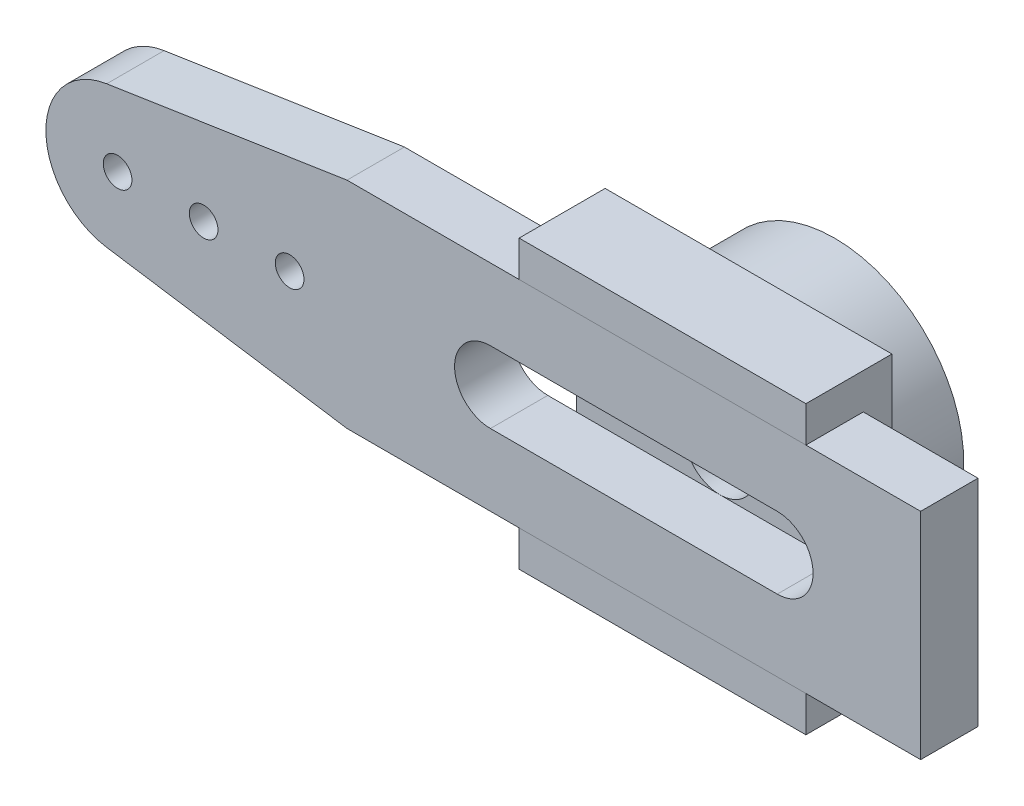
ISO-10303-21;
HEADER;
FILE_DESCRIPTION(('STEP AP214'),'2;1');
FILE_NAME('part.step','',(''),(''),'','','');
FILE_SCHEMA(('AUTOMOTIVE_DESIGN { 1 0 10303 214 1 1 1 1 }'));
ENDSEC;
DATA;
#1=APPLICATION_CONTEXT('core data for automotive mechanical design processes');
#2=APPLICATION_PROTOCOL_DEFINITION('international standard','automotive_design',2000,#1);
#3=PRODUCT_CONTEXT('',#1,'mechanical');
#4=PRODUCT('Part','Part','',(#3));
#5=PRODUCT_RELATED_PRODUCT_CATEGORY('part','',(#4));
#6=PRODUCT_DEFINITION_FORMATION('','',#4);
#7=PRODUCT_DEFINITION_CONTEXT('part definition',#1,'design');
#8=PRODUCT_DEFINITION('design','',#6,#7);
#9=PRODUCT_DEFINITION_SHAPE('','',#8);
#10=(LENGTH_UNIT() NAMED_UNIT(*) SI_UNIT(.MILLI.,.METRE.));
#11=(NAMED_UNIT(*) PLANE_ANGLE_UNIT() SI_UNIT($,.RADIAN.));
#12=(NAMED_UNIT(*) SI_UNIT($,.STERADIAN.) SOLID_ANGLE_UNIT());
#13=UNCERTAINTY_MEASURE_WITH_UNIT(LENGTH_MEASURE(1.E-05),#10,'distance_accuracy_value','');
#14=(GEOMETRIC_REPRESENTATION_CONTEXT(3) GLOBAL_UNCERTAINTY_ASSIGNED_CONTEXT((#13)) GLOBAL_UNIT_ASSIGNED_CONTEXT((#10,
#11,#12)) REPRESENTATION_CONTEXT('',''));
#15=CARTESIAN_POINT('',(0.,0.,0.));
#16=DIRECTION('',(0.,0.,1.));
#17=DIRECTION('',(1.,0.,0.));
#18=AXIS2_PLACEMENT_3D('',#15,#16,#17);
#19=CARTESIAN_POINT('',(-9.,0.,0.));
#20=DIRECTION('',(0.,0.,-1.));
#21=DIRECTION('',(0.,1.,0.));
#22=AXIS2_PLACEMENT_3D('',#19,#20,#21);
#23=CYLINDRICAL_SURFACE('',#22,1.25);
#24=CARTESIAN_POINT('',(-9.,0.,0.));
#25=DIRECTION('',(0.,0.,-1.));
#26=DIRECTION('',(0.,1.,0.));
#27=AXIS2_PLACEMENT_3D('',#24,#25,#26);
#28=CIRCLE('',#27,1.25);
#29=CARTESIAN_POINT('',(-9.,1.25,0.));
#30=VERTEX_POINT('',#29);
#31=EDGE_CURVE('E148',#30,#30,#28,.T.);
#32=ORIENTED_EDGE('',*,*,#31,.F.);
#33=EDGE_LOOP('',(#32));
#34=FACE_BOUND('',#33,.T.);
#35=CARTESIAN_POINT('',(-9.,0.,-1.3));
#36=DIRECTION('',(0.,0.,-1.));
#37=DIRECTION('',(0.,1.,0.));
#38=AXIS2_PLACEMENT_3D('',#35,#36,#37);
#39=CIRCLE('',#38,1.25);
#40=CARTESIAN_POINT('',(-9.,1.25,-1.3));
#41=VERTEX_POINT('',#40);
#42=EDGE_CURVE('E48',#41,#41,#39,.F.);
#43=ORIENTED_EDGE('',*,*,#42,.F.);
#44=EDGE_LOOP('',(#43));
#45=FACE_BOUND('',#44,.T.);
#46=ADVANCED_FACE('F44',(#34,#45),#23,.F.);
#47=CARTESIAN_POINT('',(-14.,5.,-1.));
#48=DIRECTION('',(0.,0.,-1.));
#49=DIRECTION('',(0.,1.,0.));
#50=AXIS2_PLACEMENT_3D('',#47,#48,#49);
#51=PLANE('',#50);
#52=DIRECTION('',(0.,1.,0.));
#53=VECTOR('',#52,1.);
#54=CARTESIAN_POINT('',(-4.,5.,-1.));
#55=LINE('',#54,#53);
#56=CARTESIAN_POINT('',(-4.,-5.,-1.));
#57=VERTEX_POINT('',#56);
#58=CARTESIAN_POINT('',(-4.,5.,-1.));
#59=VERTEX_POINT('',#58);
#60=EDGE_CURVE('E160',#57,#59,#55,.T.);
#61=ORIENTED_EDGE('',*,*,#60,.F.);
#62=DIRECTION('',(1.,0.,0.));
#63=VECTOR('',#62,1.);
#64=CARTESIAN_POINT('',(-14.,-5.,-1.));
#65=LINE('',#64,#63);
#66=CARTESIAN_POINT('',(-14.,-5.,-1.));
#67=VERTEX_POINT('',#66);
#68=EDGE_CURVE('E125',#67,#57,#65,.T.);
#69=ORIENTED_EDGE('',*,*,#68,.F.);
#70=DIRECTION('',(0.,1.,0.));
#71=VECTOR('',#70,1.);
#72=CARTESIAN_POINT('',(-14.,5.,-1.));
#73=LINE('',#72,#71);
#74=CARTESIAN_POINT('',(-14.,5.,-1.));
#75=VERTEX_POINT('',#74);
#76=EDGE_CURVE('E131',#67,#75,#73,.T.);
#77=ORIENTED_EDGE('',*,*,#76,.T.);
#78=DIRECTION('',(1.,0.,0.));
#79=VECTOR('',#78,1.);
#80=CARTESIAN_POINT('',(-14.,5.,-1.));
#81=LINE('',#80,#79);
#82=EDGE_CURVE('E115',#75,#59,#81,.T.);
#83=ORIENTED_EDGE('',*,*,#82,.T.);
#84=EDGE_LOOP('',(#61,#69,#77,#83));
#85=FACE_BOUND('',#84,.T.);
#86=CARTESIAN_POINT('',(-9.,0.,-1.));
#87=DIRECTION('',(0.,0.,-1.));
#88=DIRECTION('',(0.,1.,0.));
#89=AXIS2_PLACEMENT_3D('',#86,#87,#88);
#90=CIRCLE('',#89,4.50000000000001);
#91=CARTESIAN_POINT('',(-9.,4.50000000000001,-1.));
#92=VERTEX_POINT('',#91);
#93=EDGE_CURVE('E230',#92,#92,#90,.T.);
#94=ORIENTED_EDGE('',*,*,#93,.F.);
#95=EDGE_LOOP('',(#94));
#96=FACE_BOUND('',#95,.T.);
#97=ADVANCED_FACE('F135',(#85,#96),#51,.T.);
#98=CARTESIAN_POINT('',(-14.,3.75,2.));
#99=DIRECTION('',(0.,-1.,0.));
#100=DIRECTION('',(1.,0.,0.));
#101=AXIS2_PLACEMENT_3D('',#98,#99,#100);
#102=PLANE('',#101);
#103=DIRECTION('',(0.,0.,-1.));
#104=VECTOR('',#103,1.);
#105=CARTESIAN_POINT('',(-4.,3.75,2.));
#106=LINE('',#105,#104);
#107=CARTESIAN_POINT('',(-4.,3.75,2.));
#108=VERTEX_POINT('',#107);
#109=CARTESIAN_POINT('',(-4.,3.75,0.));
#110=VERTEX_POINT('',#109);
#111=EDGE_CURVE('E144',#108,#110,#106,.T.);
#112=ORIENTED_EDGE('',*,*,#111,.F.);
#113=DIRECTION('',(1.,0.,0.));
#114=VECTOR('',#113,1.);
#115=CARTESIAN_POINT('',(-14.,3.75,2.));
#116=LINE('',#115,#114);
#117=CARTESIAN_POINT('',(-14.,3.75,2.));
#118=VERTEX_POINT('',#117);
#119=EDGE_CURVE('E12',#118,#108,#116,.T.);
#120=ORIENTED_EDGE('',*,*,#119,.F.);
#121=DIRECTION('',(0.,0.,-1.));
#122=VECTOR('',#121,1.);
#123=CARTESIAN_POINT('',(-14.,3.75,2.));
#124=LINE('',#123,#122);
#125=CARTESIAN_POINT('',(-14.,3.75,0.));
#126=VERTEX_POINT('',#125);
#127=EDGE_CURVE('E165',#118,#126,#124,.T.);
#128=ORIENTED_EDGE('',*,*,#127,.T.);
#129=DIRECTION('',(1.,0.,0.));
#130=VECTOR('',#129,1.);
#131=CARTESIAN_POINT('',(-14.,3.75,0.));
#132=LINE('',#131,#130);
#133=EDGE_CURVE('E101',#126,#110,#132,.T.);
#134=ORIENTED_EDGE('',*,*,#133,.T.);
#135=EDGE_LOOP('',(#112,#120,#128,#134));
#136=FACE_BOUND('',#135,.T.);
#137=ADVANCED_FACE('F46',(#136),#102,.T.);
#138=CARTESIAN_POINT('',(-14.,3.75,2.));
#139=DIRECTION('',(0.,0.,1.));
#140=DIRECTION('',(1.,0.,0.));
#141=AXIS2_PLACEMENT_3D('',#138,#139,#140);
#142=PLANE('',#141);
#143=DIRECTION('',(0.,-1.,0.));
#144=VECTOR('',#143,1.);
#145=CARTESIAN_POINT('',(-4.,3.75,2.));
#146=LINE('',#145,#144);
#147=CARTESIAN_POINT('',(-4.,5.,2.));
#148=VERTEX_POINT('',#147);
#149=EDGE_CURVE('E163',#148,#108,#146,.T.);
#150=ORIENTED_EDGE('',*,*,#149,.F.);
#151=DIRECTION('',(1.,0.,0.));
#152=VECTOR('',#151,1.);
#153=CARTESIAN_POINT('',(-14.,5.,2.));
#154=LINE('',#153,#152);
#155=CARTESIAN_POINT('',(-14.,5.,2.));
#156=VERTEX_POINT('',#155);
#157=EDGE_CURVE('E54',#156,#148,#154,.T.);
#158=ORIENTED_EDGE('',*,*,#157,.F.);
#159=DIRECTION('',(0.,-1.,0.));
#160=VECTOR('',#159,1.);
#161=CARTESIAN_POINT('',(-14.,3.75,2.));
#162=LINE('',#161,#160);
#163=EDGE_CURVE('E133',#156,#118,#162,.T.);
#164=ORIENTED_EDGE('',*,*,#163,.T.);
#165=ORIENTED_EDGE('',*,*,#119,.T.);
#166=EDGE_LOOP('',(#150,#158,#164,#165));
#167=FACE_BOUND('',#166,.T.);
#168=ADVANCED_FACE('F178',(#167),#142,.T.);
#169=CARTESIAN_POINT('',(-14.,5.,2.));
#170=DIRECTION('',(0.,1.,0.));
#171=DIRECTION('',(-1.,0.,0.));
#172=AXIS2_PLACEMENT_3D('',#169,#170,#171);
#173=PLANE('',#172);
#174=DIRECTION('',(0.,0.,1.));
#175=VECTOR('',#174,1.);
#176=CARTESIAN_POINT('',(-4.,5.,2.));
#177=LINE('',#176,#175);
#178=EDGE_CURVE('E120',#59,#148,#177,.T.);
#179=ORIENTED_EDGE('',*,*,#178,.F.);
#180=ORIENTED_EDGE('',*,*,#82,.F.);
#181=DIRECTION('',(0.,0.,1.));
#182=VECTOR('',#181,1.);
#183=CARTESIAN_POINT('',(-14.,5.,2.));
#184=LINE('',#183,#182);
#185=EDGE_CURVE('E118',#75,#156,#184,.T.);
#186=ORIENTED_EDGE('',*,*,#185,.T.);
#187=ORIENTED_EDGE('',*,*,#157,.T.);
#188=EDGE_LOOP('',(#179,#180,#186,#187));
#189=FACE_BOUND('',#188,.T.);
#190=ADVANCED_FACE('F117',(#189),#173,.T.);
#191=CARTESIAN_POINT('',(-14.,-5.,-1.));
#192=DIRECTION('',(0.,-1.,0.));
#193=DIRECTION('',(1.,0.,0.));
#194=AXIS2_PLACEMENT_3D('',#191,#192,#193);
#195=PLANE('',#194);
#196=DIRECTION('',(0.,0.,-1.));
#197=VECTOR('',#196,1.);
#198=CARTESIAN_POINT('',(-4.,-5.,-1.));
#199=LINE('',#198,#197);
#200=CARTESIAN_POINT('',(-4.,-5.,2.));
#201=VERTEX_POINT('',#200);
#202=EDGE_CURVE('E157',#201,#57,#199,.T.);
#203=ORIENTED_EDGE('',*,*,#202,.F.);
#204=DIRECTION('',(1.,0.,0.));
#205=VECTOR('',#204,1.);
#206=CARTESIAN_POINT('',(-14.,-5.,2.));
#207=LINE('',#206,#205);
#208=CARTESIAN_POINT('',(-14.,-5.,2.));
#209=VERTEX_POINT('',#208);
#210=EDGE_CURVE('E169',#209,#201,#207,.T.);
#211=ORIENTED_EDGE('',*,*,#210,.F.);
#212=DIRECTION('',(0.,0.,-1.));
#213=VECTOR('',#212,1.);
#214=CARTESIAN_POINT('',(-14.,-5.,-1.));
#215=LINE('',#214,#213);
#216=EDGE_CURVE('E137',#209,#67,#215,.T.);
#217=ORIENTED_EDGE('',*,*,#216,.T.);
#218=ORIENTED_EDGE('',*,*,#68,.T.);
#219=EDGE_LOOP('',(#203,#211,#217,#218));
#220=FACE_BOUND('',#219,.T.);
#221=ADVANCED_FACE('F185',(#220),#195,.T.);
#222=CARTESIAN_POINT('',(-14.,-5.,2.));
#223=DIRECTION('',(0.,0.,1.));
#224=DIRECTION('',(1.,0.,0.));
#225=AXIS2_PLACEMENT_3D('',#222,#223,#224);
#226=PLANE('',#225);
#227=DIRECTION('',(0.,-1.,0.));
#228=VECTOR('',#227,1.);
#229=CARTESIAN_POINT('',(-4.,-5.,2.));
#230=LINE('',#229,#228);
#231=CARTESIAN_POINT('',(-4.,-3.75,2.));
#232=VERTEX_POINT('',#231);
#233=EDGE_CURVE('E154',#232,#201,#230,.T.);
#234=ORIENTED_EDGE('',*,*,#233,.F.);
#235=DIRECTION('',(1.,0.,0.));
#236=VECTOR('',#235,1.);
#237=CARTESIAN_POINT('',(-14.,-3.75,2.));
#238=LINE('',#237,#236);
#239=CARTESIAN_POINT('',(-14.,-3.75,2.));
#240=VERTEX_POINT('',#239);
#241=EDGE_CURVE('E171',#240,#232,#238,.T.);
#242=ORIENTED_EDGE('',*,*,#241,.F.);
#243=DIRECTION('',(0.,-1.,0.));
#244=VECTOR('',#243,1.);
#245=CARTESIAN_POINT('',(-14.,-5.,2.));
#246=LINE('',#245,#244);
#247=EDGE_CURVE('E139',#240,#209,#246,.T.);
#248=ORIENTED_EDGE('',*,*,#247,.T.);
#249=ORIENTED_EDGE('',*,*,#210,.T.);
#250=EDGE_LOOP('',(#234,#242,#248,#249));
#251=FACE_BOUND('',#250,.T.);
#252=ADVANCED_FACE('F252',(#251),#226,.T.);
#253=CARTESIAN_POINT('',(-14.,-3.75,2.));
#254=DIRECTION('',(0.,1.,0.));
#255=DIRECTION('',(-1.,0.,0.));
#256=AXIS2_PLACEMENT_3D('',#253,#254,#255);
#257=PLANE('',#256);
#258=DIRECTION('',(0.,0.,1.));
#259=VECTOR('',#258,1.);
#260=CARTESIAN_POINT('',(-4.,-3.75,2.));
#261=LINE('',#260,#259);
#262=CARTESIAN_POINT('',(-4.,-3.75,0.));
#263=VERTEX_POINT('',#262);
#264=EDGE_CURVE('E151',#263,#232,#261,.T.);
#265=ORIENTED_EDGE('',*,*,#264,.F.);
#266=DIRECTION('',(1.,0.,0.));
#267=VECTOR('',#266,1.);
#268=CARTESIAN_POINT('',(-14.,-3.75,0.));
#269=LINE('',#268,#267);
#270=CARTESIAN_POINT('',(-14.,-3.75,0.));
#271=VERTEX_POINT('',#270);
#272=EDGE_CURVE('E173',#271,#263,#269,.T.);
#273=ORIENTED_EDGE('',*,*,#272,.F.);
#274=DIRECTION('',(0.,0.,1.));
#275=VECTOR('',#274,1.);
#276=CARTESIAN_POINT('',(-14.,-3.75,2.));
#277=LINE('',#276,#275);
#278=EDGE_CURVE('E246',#271,#240,#277,.T.);
#279=ORIENTED_EDGE('',*,*,#278,.T.);
#280=ORIENTED_EDGE('',*,*,#241,.T.);
#281=EDGE_LOOP('',(#265,#273,#279,#280));
#282=FACE_BOUND('',#281,.T.);
#283=ADVANCED_FACE('F256',(#282),#257,.T.);
#284=CARTESIAN_POINT('',(-14.,-3.75,0.));
#285=DIRECTION('',(0.,0.,1.));
#286=DIRECTION('',(1.,0.,0.));
#287=AXIS2_PLACEMENT_3D('',#284,#285,#286);
#288=PLANE('',#287);
#289=ORIENTED_EDGE('',*,*,#31,.T.);
#290=EDGE_LOOP('',(#289));
#291=FACE_BOUND('',#290,.T.);
#292=DIRECTION('',(0.,-1.,0.));
#293=VECTOR('',#292,1.);
#294=CARTESIAN_POINT('',(-4.,-3.75,0.));
#295=LINE('',#294,#293);
#296=EDGE_CURVE('E147',#110,#263,#295,.T.);
#297=ORIENTED_EDGE('',*,*,#296,.F.);
#298=ORIENTED_EDGE('',*,*,#133,.F.);
#299=DIRECTION('',(0.,-1.,0.));
#300=VECTOR('',#299,1.);
#301=CARTESIAN_POINT('',(-14.,-3.75,0.));
#302=LINE('',#301,#300);
#303=EDGE_CURVE('E244',#126,#271,#302,.T.);
#304=ORIENTED_EDGE('',*,*,#303,.T.);
#305=ORIENTED_EDGE('',*,*,#272,.T.);
#306=EDGE_LOOP('',(#297,#298,#304,#305));
#307=FACE_BOUND('',#306,.T.);
#308=ADVANCED_FACE('F174',(#291,#307),#288,.T.);
#309=CARTESIAN_POINT('',(-14.,3.75,0.));
#310=DIRECTION('',(1.,0.,0.));
#311=DIRECTION('',(0.,1.,0.));
#312=AXIS2_PLACEMENT_3D('',#309,#310,#311);
#313=PLANE('',#312);
#314=ORIENTED_EDGE('',*,*,#127,.F.);
#315=ORIENTED_EDGE('',*,*,#163,.F.);
#316=ORIENTED_EDGE('',*,*,#185,.F.);
#317=ORIENTED_EDGE('',*,*,#76,.F.);
#318=ORIENTED_EDGE('',*,*,#216,.F.);
#319=ORIENTED_EDGE('',*,*,#247,.F.);
#320=ORIENTED_EDGE('',*,*,#278,.F.);
#321=ORIENTED_EDGE('',*,*,#303,.F.);
#322=EDGE_LOOP('',(#314,#315,#316,#317,#318,#319,#320,#321));
#323=FACE_BOUND('',#322,.T.);
#324=ADVANCED_FACE('F129',(#323),#313,.F.);
#325=CARTESIAN_POINT('',(-4.,3.75,0.));
#326=DIRECTION('',(1.,0.,0.));
#327=DIRECTION('',(0.,1.,0.));
#328=AXIS2_PLACEMENT_3D('',#325,#326,#327);
#329=PLANE('',#328);
#330=ORIENTED_EDGE('',*,*,#111,.T.);
#331=ORIENTED_EDGE('',*,*,#296,.T.);
#332=ORIENTED_EDGE('',*,*,#264,.T.);
#333=ORIENTED_EDGE('',*,*,#233,.T.);
#334=ORIENTED_EDGE('',*,*,#202,.T.);
#335=ORIENTED_EDGE('',*,*,#60,.T.);
#336=ORIENTED_EDGE('',*,*,#178,.T.);
#337=ORIENTED_EDGE('',*,*,#149,.T.);
#338=EDGE_LOOP('',(#330,#331,#332,#333,#334,#335,#336,#337));
#339=FACE_BOUND('',#338,.T.);
#340=ADVANCED_FACE('F177',(#339),#329,.T.);
#341=CARTESIAN_POINT('',(-9.,0.,-4.));
#342=DIRECTION('',(0.,0.,-1.));
#343=DIRECTION('',(0.,1.,0.));
#344=AXIS2_PLACEMENT_3D('',#341,#342,#343);
#345=PLANE('',#344);
#346=CARTESIAN_POINT('',(-9.,0.,-4.));
#347=DIRECTION('',(0.,0.,-1.));
#348=DIRECTION('',(0.,1.,0.));
#349=AXIS2_PLACEMENT_3D('',#346,#347,#348);
#350=CIRCLE('',#349,2.9);
#351=CARTESIAN_POINT('',(-9.,2.9,-4.));
#352=VERTEX_POINT('',#351);
#353=EDGE_CURVE('E234',#352,#352,#350,.T.);
#354=ORIENTED_EDGE('',*,*,#353,.F.);
#355=EDGE_LOOP('',(#354));
#356=FACE_BOUND('',#355,.T.);
#357=CARTESIAN_POINT('',(-9.,0.,-4.));
#358=DIRECTION('',(0.,0.,-1.));
#359=DIRECTION('',(0.,1.,0.));
#360=AXIS2_PLACEMENT_3D('',#357,#358,#359);
#361=CIRCLE('',#360,4.50000000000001);
#362=CARTESIAN_POINT('',(-9.,4.50000000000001,-4.));
#363=VERTEX_POINT('',#362);
#364=EDGE_CURVE('E232',#363,#363,#361,.T.);
#365=ORIENTED_EDGE('',*,*,#364,.T.);
#366=EDGE_LOOP('',(#365));
#367=FACE_BOUND('',#366,.T.);
#368=ADVANCED_FACE('F203',(#356,#367),#345,.T.);
#369=CARTESIAN_POINT('',(-9.,0.,-4.));
#370=DIRECTION('',(0.,0.,1.));
#371=DIRECTION('',(0.,-1.,0.));
#372=AXIS2_PLACEMENT_3D('',#369,#370,#371);
#373=CYLINDRICAL_SURFACE('',#372,4.50000000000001);
#374=ORIENTED_EDGE('',*,*,#364,.F.);
#375=EDGE_LOOP('',(#374));
#376=FACE_BOUND('',#375,.T.);
#377=ORIENTED_EDGE('',*,*,#93,.T.);
#378=EDGE_LOOP('',(#377));
#379=FACE_BOUND('',#378,.T.);
#380=ADVANCED_FACE('F199',(#376,#379),#373,.T.);
#381=CARTESIAN_POINT('',(-9.,0.,-1.3));
#382=DIRECTION('',(0.,0.,-1.));
#383=DIRECTION('',(0.,1.,0.));
#384=AXIS2_PLACEMENT_3D('',#381,#382,#383);
#385=PLANE('',#384);
#386=CARTESIAN_POINT('',(-9.,0.,-1.3));
#387=DIRECTION('',(0.,0.,-1.));
#388=DIRECTION('',(0.,1.,0.));
#389=AXIS2_PLACEMENT_3D('',#386,#387,#388);
#390=CIRCLE('',#389,2.9);
#391=CARTESIAN_POINT('',(-9.,2.9,-1.3));
#392=VERTEX_POINT('',#391);
#393=EDGE_CURVE('E227',#392,#392,#390,.T.);
#394=ORIENTED_EDGE('',*,*,#393,.T.);
#395=EDGE_LOOP('',(#394));
#396=FACE_BOUND('',#395,.T.);
#397=ORIENTED_EDGE('',*,*,#42,.T.);
#398=EDGE_LOOP('',(#397));
#399=FACE_BOUND('',#398,.T.);
#400=ADVANCED_FACE('F211',(#396,#399),#385,.T.);
#401=CARTESIAN_POINT('',(-9.,0.,-1.3));
#402=DIRECTION('',(0.,0.,-1.));
#403=DIRECTION('',(0.,1.,0.));
#404=AXIS2_PLACEMENT_3D('',#401,#402,#403);
#405=CYLINDRICAL_SURFACE('',#404,2.9);
#406=CARTESIAN_POINT('',(-9.,2.9,-1.3));
#407=CARTESIAN_POINT('',(-9.,2.9,-1.328125));
#408=CARTESIAN_POINT('',(-9.,2.9,-1.35625));
#409=CARTESIAN_POINT('',(-9.,2.9,-1.4125));
#410=CARTESIAN_POINT('',(-9.,2.9,-1.440625));
#411=CARTESIAN_POINT('',(-9.,2.9,-1.496875));
#412=CARTESIAN_POINT('',(-9.,2.9,-1.525));
#413=CARTESIAN_POINT('',(-9.,2.9,-1.58125));
#414=CARTESIAN_POINT('',(-9.,2.9,-1.609375));
#415=CARTESIAN_POINT('',(-9.,2.9,-1.665625));
#416=CARTESIAN_POINT('',(-9.,2.9,-1.69375));
#417=CARTESIAN_POINT('',(-9.,2.9,-1.75));
#418=CARTESIAN_POINT('',(-9.,2.9,-1.778125));
#419=CARTESIAN_POINT('',(-9.,2.9,-1.834375));
#420=CARTESIAN_POINT('',(-9.,2.9,-1.8625));
#421=CARTESIAN_POINT('',(-9.,2.9,-1.91875));
#422=CARTESIAN_POINT('',(-9.,2.9,-1.946875));
#423=CARTESIAN_POINT('',(-9.,2.9,-2.003125));
#424=CARTESIAN_POINT('',(-9.,2.9,-2.03125));
#425=CARTESIAN_POINT('',(-9.,2.9,-2.0875));
#426=CARTESIAN_POINT('',(-9.,2.9,-2.115625));
#427=CARTESIAN_POINT('',(-9.,2.9,-2.171875));
#428=CARTESIAN_POINT('',(-9.,2.9,-2.2));
#429=CARTESIAN_POINT('',(-9.,2.9,-2.25625));
#430=CARTESIAN_POINT('',(-9.,2.9,-2.284375));
#431=CARTESIAN_POINT('',(-9.,2.9,-2.340625));
#432=CARTESIAN_POINT('',(-9.,2.9,-2.36875));
#433=CARTESIAN_POINT('',(-9.,2.9,-2.425));
#434=CARTESIAN_POINT('',(-9.,2.9,-2.453125));
#435=CARTESIAN_POINT('',(-9.,2.9,-2.509375));
#436=CARTESIAN_POINT('',(-9.,2.9,-2.5375));
#437=CARTESIAN_POINT('',(-9.,2.9,-2.59375));
#438=CARTESIAN_POINT('',(-9.,2.9,-2.621875));
#439=CARTESIAN_POINT('',(-9.,2.9,-2.678125));
#440=CARTESIAN_POINT('',(-9.,2.9,-2.70625));
#441=CARTESIAN_POINT('',(-9.,2.9,-2.7625));
#442=CARTESIAN_POINT('',(-9.,2.9,-2.790625));
#443=CARTESIAN_POINT('',(-9.,2.9,-2.846875));
#444=CARTESIAN_POINT('',(-9.,2.9,-2.875));
#445=CARTESIAN_POINT('',(-9.,2.9,-2.93125));
#446=CARTESIAN_POINT('',(-9.,2.9,-2.959375));
#447=CARTESIAN_POINT('',(-9.,2.9,-3.015625));
#448=CARTESIAN_POINT('',(-9.,2.9,-3.04375));
#449=CARTESIAN_POINT('',(-9.,2.9,-3.1));
#450=CARTESIAN_POINT('',(-9.,2.9,-3.128125));
#451=CARTESIAN_POINT('',(-9.,2.9,-3.184375));
#452=CARTESIAN_POINT('',(-9.,2.9,-3.2125));
#453=CARTESIAN_POINT('',(-9.,2.9,-3.26875));
#454=CARTESIAN_POINT('',(-9.,2.9,-3.296875));
#455=CARTESIAN_POINT('',(-9.,2.9,-3.353125));
#456=CARTESIAN_POINT('',(-9.,2.9,-3.38125));
#457=CARTESIAN_POINT('',(-9.,2.9,-3.4375));
#458=CARTESIAN_POINT('',(-9.,2.9,-3.465625));
#459=CARTESIAN_POINT('',(-9.,2.9,-3.521875));
#460=CARTESIAN_POINT('',(-9.,2.9,-3.55));
#461=CARTESIAN_POINT('',(-9.,2.9,-3.60625));
#462=CARTESIAN_POINT('',(-9.,2.9,-3.634375));
#463=CARTESIAN_POINT('',(-9.,2.9,-3.690625));
#464=CARTESIAN_POINT('',(-9.,2.9,-3.71875));
#465=CARTESIAN_POINT('',(-9.,2.9,-3.775));
#466=CARTESIAN_POINT('',(-9.,2.9,-3.803125));
#467=CARTESIAN_POINT('',(-9.,2.9,-3.859375));
#468=CARTESIAN_POINT('',(-9.,2.9,-3.8875));
#469=CARTESIAN_POINT('',(-9.,2.9,-3.94375));
#470=CARTESIAN_POINT('',(-9.,2.9,-3.971875));
#471=CARTESIAN_POINT('',(-9.,2.9,-4.));
#472=B_SPLINE_CURVE_WITH_KNOTS('',3,(#406,#407,#408,#409,#410,#411,#412,#413,#414,#415,#416,
#417,#418,#419,#420,#421,#422,#423,#424,#425,#426,#427,#428,#429,#430,#431,#432,#433,#434,#435,
#436,#437,#438,#439,#440,#441,#442,#443,#444,#445,#446,#447,#448,#449,#450,#451,#452,#453,#454,
#455,#456,#457,#458,#459,#460,#461,#462,#463,#464,#465,#466,#467,#468,#469,#470,#471),
.UNSPECIFIED.,.F.,.F.,(4,2,2,2,2,2,2,2,2,2,2,2,2,2,2,2,2,2,2,2,2,2,2,2,2,2,2,2,2,2,2,2,4),(0.,
0.0843749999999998,0.16875,0.253125,0.3375,0.421875,0.50625,0.590625,0.675,0.759375,0.84375,
0.928125,1.0125,1.096875,1.18125,1.265625,1.35,1.434375,1.51875,1.603125,1.6875,1.771875,
1.85625,1.940625,2.025,2.109375,2.19375,2.278125,2.3625,2.446875,2.53125,2.615625,2.7),.UNSPECIFIED.);
#473=EDGE_CURVE('BSEAM216',#392,#352,#472,.T.);
#474=ORIENTED_EDGE('',*,*,#393,.F.);
#475=ORIENTED_EDGE('',*,*,#353,.T.);
#476=ORIENTED_EDGE('',*,*,#473,.T.);
#477=ORIENTED_EDGE('',*,*,#473,.F.);
#478=EDGE_LOOP('',(#474,#476,#475,#477));
#479=FACE_BOUND('',#478,.T.);
#480=ADVANCED_FACE('F216',(#479),#405,.F.);
#481=CLOSED_SHELL('',(#46,#97,#137,#168,#190,#221,#252,#283,#308,#324,#340,#368,#380,#400,#480));
#482=MANIFOLD_SOLID_BREP('B2',#481);
#483=CARTESIAN_POINT('',(-28.,0.,2.));
#484=DIRECTION('',(0.,0.,1.));
#485=DIRECTION('',(1.,0.,0.));
#486=AXIS2_PLACEMENT_3D('',#483,#484,#485);
#487=PLANE('',#486);
#488=CARTESIAN_POINT('',(-22.,0.,2.));
#489=DIRECTION('',(0.,0.,1.));
#490=DIRECTION('',(1.,0.,0.));
#491=AXIS2_PLACEMENT_3D('',#488,#489,#490);
#492=CIRCLE('',#491,0.499999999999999);
#493=CARTESIAN_POINT('',(-21.5,0.,2.));
#494=VERTEX_POINT('',#493);
#495=EDGE_CURVE('E468',#494,#494,#492,.T.);
#496=ORIENTED_EDGE('',*,*,#495,.F.);
#497=EDGE_LOOP('',(#496));
#498=FACE_BOUND('',#497,.T.);
#499=CARTESIAN_POINT('',(-28.,0.,2.));
#500=DIRECTION('',(0.,0.,1.));
#501=DIRECTION('',(1.,0.,0.));
#502=AXIS2_PLACEMENT_3D('',#499,#500,#501);
#503=CIRCLE('',#502,0.499999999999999);
#504=CARTESIAN_POINT('',(-27.5,0.,2.));
#505=VERTEX_POINT('',#504);
#506=EDGE_CURVE('E480',#505,#505,#503,.T.);
#507=ORIENTED_EDGE('',*,*,#506,.F.);
#508=EDGE_LOOP('',(#507));
#509=FACE_BOUND('',#508,.T.);
#510=DIRECTION('',(-1.,0.,0.));
#511=VECTOR('',#510,1.);
#512=CARTESIAN_POINT('',(0.,3.75,2.));
#513=LINE('',#512,#511);
#514=CARTESIAN_POINT('',(0.,3.75,2.));
#515=VERTEX_POINT('',#514);
#516=CARTESIAN_POINT('',(-20.,3.75,2.));
#517=VERTEX_POINT('',#516);
#518=EDGE_CURVE('E486',#515,#517,#513,.T.);
#519=ORIENTED_EDGE('',*,*,#518,.T.);
#520=DIRECTION('',(-0.988551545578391,-0.15088353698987,0.));
#521=VECTOR('',#520,1.);
#522=CARTESIAN_POINT('',(-20.,3.75,2.));
#523=LINE('',#522,#521);
#524=CARTESIAN_POINT('',(-28.3772088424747,2.47137886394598,2.));
#525=VERTEX_POINT('',#524);
#526=EDGE_CURVE('E489',#517,#525,#523,.T.);
#527=ORIENTED_EDGE('',*,*,#526,.T.);
#528=CARTESIAN_POINT('',(-28.,0.,2.));
#529=DIRECTION('',(0.,0.,1.));
#530=DIRECTION('',(1.,0.,0.));
#531=AXIS2_PLACEMENT_3D('',#528,#529,#530);
#532=CIRCLE('',#531,2.5);
#533=CARTESIAN_POINT('',(-28.3772088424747,-2.47137886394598,2.));
#534=VERTEX_POINT('',#533);
#535=EDGE_CURVE('E492',#525,#534,#532,.T.);
#536=ORIENTED_EDGE('',*,*,#535,.T.);
#537=DIRECTION('',(0.988551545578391,-0.15088353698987,0.));
#538=VECTOR('',#537,1.);
#539=CARTESIAN_POINT('',(-20.,-3.75,2.));
#540=LINE('',#539,#538);
#541=CARTESIAN_POINT('',(-20.,-3.75,2.));
#542=VERTEX_POINT('',#541);
#543=EDGE_CURVE('E494',#534,#542,#540,.T.);
#544=ORIENTED_EDGE('',*,*,#543,.T.);
#545=DIRECTION('',(1.,0.,0.));
#546=VECTOR('',#545,1.);
#547=CARTESIAN_POINT('',(0.,-3.75,2.));
#548=LINE('',#547,#546);
#549=CARTESIAN_POINT('',(0.,-3.75,2.));
#550=VERTEX_POINT('',#549);
#551=EDGE_CURVE('E496',#542,#550,#548,.T.);
#552=ORIENTED_EDGE('',*,*,#551,.T.);
#553=DIRECTION('',(0.,1.,0.));
#554=VECTOR('',#553,1.);
#555=CARTESIAN_POINT('',(0.,3.75,2.));
#556=LINE('',#555,#554);
#557=EDGE_CURVE('E498',#550,#515,#556,.T.);
#558=ORIENTED_EDGE('',*,*,#557,.T.);
#559=EDGE_LOOP('',(#519,#527,#536,#544,#552,#558));
#560=FACE_BOUND('',#559,.T.);
#561=CARTESIAN_POINT('',(-25.,0.,2.));
#562=DIRECTION('',(0.,0.,1.));
#563=DIRECTION('',(1.,0.,0.));
#564=AXIS2_PLACEMENT_3D('',#561,#562,#563);
#565=CIRCLE('',#564,0.499999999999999);
#566=CARTESIAN_POINT('',(-24.5,0.,2.));
#567=VERTEX_POINT('',#566);
#568=EDGE_CURVE('E474',#567,#567,#565,.T.);
#569=ORIENTED_EDGE('',*,*,#568,.F.);
#570=EDGE_LOOP('',(#569));
#571=FACE_BOUND('',#570,.T.);
#572=DIRECTION('',(1.,0.,0.));
#573=VECTOR('',#572,1.);
#574=CARTESIAN_POINT('',(-5.,-1.25,2.));
#575=LINE('',#574,#573);
#576=CARTESIAN_POINT('',(-15.,-1.25,2.));
#577=VERTEX_POINT('',#576);
#578=CARTESIAN_POINT('',(-5.,-1.25,2.));
#579=VERTEX_POINT('',#578);
#580=EDGE_CURVE('E440',#577,#579,#575,.T.);
#581=ORIENTED_EDGE('',*,*,#580,.F.);
#582=CARTESIAN_POINT('',(-15.,0.,2.));
#583=DIRECTION('',(0.,0.,1.));
#584=DIRECTION('',(-1.,0.,0.));
#585=AXIS2_PLACEMENT_3D('',#582,#583,#584);
#586=CIRCLE('',#585,1.25);
#587=CARTESIAN_POINT('',(-15.,1.25,2.));
#588=VERTEX_POINT('',#587);
#589=EDGE_CURVE('E432',#588,#577,#586,.T.);
#590=ORIENTED_EDGE('',*,*,#589,.F.);
#591=DIRECTION('',(-1.,0.,0.));
#592=VECTOR('',#591,1.);
#593=CARTESIAN_POINT('',(-15.,1.25,2.));
#594=LINE('',#593,#592);
#595=CARTESIAN_POINT('',(-5.,1.25,2.));
#596=VERTEX_POINT('',#595);
#597=EDGE_CURVE('E454',#596,#588,#594,.T.);
#598=ORIENTED_EDGE('',*,*,#597,.F.);
#599=CARTESIAN_POINT('',(-5.,0.,2.));
#600=DIRECTION('',(0.,0.,1.));
#601=DIRECTION('',(-1.,0.,0.));
#602=AXIS2_PLACEMENT_3D('',#599,#600,#601);
#603=CIRCLE('',#602,1.25);
#604=EDGE_CURVE('E452',#579,#596,#603,.T.);
#605=ORIENTED_EDGE('',*,*,#604,.F.);
#606=EDGE_LOOP('',(#581,#590,#598,#605));
#607=FACE_BOUND('',#606,.T.);
#608=ADVANCED_FACE('F355',(#498,#509,#560,#571,#607),#487,.T.);
#609=CARTESIAN_POINT('',(-28.,0.,0.));
#610=DIRECTION('',(0.,0.,1.));
#611=DIRECTION('',(1.,0.,0.));
#612=AXIS2_PLACEMENT_3D('',#609,#610,#611);
#613=PLANE('',#612);
#614=CARTESIAN_POINT('',(-22.,0.,0.));
#615=DIRECTION('',(0.,0.,1.));
#616=DIRECTION('',(1.,0.,0.));
#617=AXIS2_PLACEMENT_3D('',#614,#615,#616);
#618=CIRCLE('',#617,0.499999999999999);
#619=CARTESIAN_POINT('',(-21.5,0.,0.));
#620=VERTEX_POINT('',#619);
#621=EDGE_CURVE('E448',#620,#620,#618,.T.);
#622=ORIENTED_EDGE('',*,*,#621,.T.);
#623=EDGE_LOOP('',(#622));
#624=FACE_BOUND('',#623,.T.);
#625=CARTESIAN_POINT('',(-28.,0.,0.));
#626=DIRECTION('',(0.,0.,1.));
#627=DIRECTION('',(1.,0.,0.));
#628=AXIS2_PLACEMENT_3D('',#625,#626,#627);
#629=CIRCLE('',#628,0.499999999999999);
#630=CARTESIAN_POINT('',(-27.5,0.,0.));
#631=VERTEX_POINT('',#630);
#632=EDGE_CURVE('E477',#631,#631,#629,.T.);
#633=ORIENTED_EDGE('',*,*,#632,.T.);
#634=EDGE_LOOP('',(#633));
#635=FACE_BOUND('',#634,.T.);
#636=DIRECTION('',(-1.,0.,0.));
#637=VECTOR('',#636,1.);
#638=CARTESIAN_POINT('',(0.,3.75,0.));
#639=LINE('',#638,#637);
#640=CARTESIAN_POINT('',(0.,3.75,0.));
#641=VERTEX_POINT('',#640);
#642=CARTESIAN_POINT('',(-20.,3.75,0.));
#643=VERTEX_POINT('',#642);
#644=EDGE_CURVE('E483',#641,#643,#639,.T.);
#645=ORIENTED_EDGE('',*,*,#644,.F.);
#646=DIRECTION('',(0.,1.,0.));
#647=VECTOR('',#646,1.);
#648=CARTESIAN_POINT('',(0.,3.75,0.));
#649=LINE('',#648,#647);
#650=CARTESIAN_POINT('',(0.,-3.75,0.));
#651=VERTEX_POINT('',#650);
#652=EDGE_CURVE('E490',#651,#641,#649,.T.);
#653=ORIENTED_EDGE('',*,*,#652,.F.);
#654=DIRECTION('',(1.,0.,0.));
#655=VECTOR('',#654,1.);
#656=CARTESIAN_POINT('',(0.,-3.75,0.));
#657=LINE('',#656,#655);
#658=CARTESIAN_POINT('',(-20.,-3.75,0.));
#659=VERTEX_POINT('',#658);
#660=EDGE_CURVE('E509',#659,#651,#657,.T.);
#661=ORIENTED_EDGE('',*,*,#660,.F.);
#662=DIRECTION('',(0.988551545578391,-0.15088353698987,0.));
#663=VECTOR('',#662,1.);
#664=CARTESIAN_POINT('',(-20.,-3.75,0.));
#665=LINE('',#664,#663);
#666=CARTESIAN_POINT('',(-28.3772088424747,-2.47137886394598,0.));
#667=VERTEX_POINT('',#666);
#668=EDGE_CURVE('E507',#667,#659,#665,.T.);
#669=ORIENTED_EDGE('',*,*,#668,.F.);
#670=CARTESIAN_POINT('',(-28.,0.,0.));
#671=DIRECTION('',(0.,0.,1.));
#672=DIRECTION('',(1.,0.,0.));
#673=AXIS2_PLACEMENT_3D('',#670,#671,#672);
#674=CIRCLE('',#673,2.5);
#675=CARTESIAN_POINT('',(-28.3772088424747,2.47137886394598,0.));
#676=VERTEX_POINT('',#675);
#677=EDGE_CURVE('E505',#676,#667,#674,.T.);
#678=ORIENTED_EDGE('',*,*,#677,.F.);
#679=DIRECTION('',(-0.988551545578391,-0.15088353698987,0.));
#680=VECTOR('',#679,1.);
#681=CARTESIAN_POINT('',(-20.,3.75,0.));
#682=LINE('',#681,#680);
#683=EDGE_CURVE('E503',#643,#676,#682,.T.);
#684=ORIENTED_EDGE('',*,*,#683,.F.);
#685=EDGE_LOOP('',(#645,#653,#661,#669,#678,#684));
#686=FACE_BOUND('',#685,.T.);
#687=CARTESIAN_POINT('',(-25.,0.,0.));
#688=DIRECTION('',(0.,0.,1.));
#689=DIRECTION('',(1.,0.,0.));
#690=AXIS2_PLACEMENT_3D('',#687,#688,#689);
#691=CIRCLE('',#690,0.499999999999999);
#692=CARTESIAN_POINT('',(-24.5,0.,0.));
#693=VERTEX_POINT('',#692);
#694=EDGE_CURVE('E471',#693,#693,#691,.T.);
#695=ORIENTED_EDGE('',*,*,#694,.T.);
#696=EDGE_LOOP('',(#695));
#697=FACE_BOUND('',#696,.T.);
#698=CARTESIAN_POINT('',(-15.,0.,0.));
#699=DIRECTION('',(0.,0.,1.));
#700=DIRECTION('',(-1.,0.,0.));
#701=AXIS2_PLACEMENT_3D('',#698,#699,#700);
#702=CIRCLE('',#701,1.25);
#703=CARTESIAN_POINT('',(-15.,1.25,0.));
#704=VERTEX_POINT('',#703);
#705=CARTESIAN_POINT('',(-15.,-1.25,0.));
#706=VERTEX_POINT('',#705);
#707=EDGE_CURVE('E378',#704,#706,#702,.T.);
#708=ORIENTED_EDGE('',*,*,#707,.T.);
#709=DIRECTION('',(1.,0.,0.));
#710=VECTOR('',#709,1.);
#711=CARTESIAN_POINT('',(-5.,-1.25,0.));
#712=LINE('',#711,#710);
#713=CARTESIAN_POINT('',(-5.,-1.25,0.));
#714=VERTEX_POINT('',#713);
#715=EDGE_CURVE('E447',#706,#714,#712,.T.);
#716=ORIENTED_EDGE('',*,*,#715,.T.);
#717=CARTESIAN_POINT('',(-5.,0.,0.));
#718=DIRECTION('',(0.,0.,1.));
#719=DIRECTION('',(-1.,0.,0.));
#720=AXIS2_PLACEMENT_3D('',#717,#718,#719);
#721=CIRCLE('',#720,1.25);
#722=CARTESIAN_POINT('',(-5.,1.25,0.));
#723=VERTEX_POINT('',#722);
#724=EDGE_CURVE('E460',#714,#723,#721,.T.);
#725=ORIENTED_EDGE('',*,*,#724,.T.);
#726=DIRECTION('',(-1.,0.,0.));
#727=VECTOR('',#726,1.);
#728=CARTESIAN_POINT('',(-15.,1.25,0.));
#729=LINE('',#728,#727);
#730=EDGE_CURVE('E441',#723,#704,#729,.T.);
#731=ORIENTED_EDGE('',*,*,#730,.T.);
#732=EDGE_LOOP('',(#708,#716,#725,#731));
#733=FACE_BOUND('',#732,.T.);
#734=ADVANCED_FACE('F533',(#624,#635,#686,#697,#733),#613,.F.);
#735=CARTESIAN_POINT('',(0.,3.75,2.));
#736=DIRECTION('',(0.,-1.,0.));
#737=DIRECTION('',(1.,0.,0.));
#738=AXIS2_PLACEMENT_3D('',#735,#736,#737);
#739=PLANE('',#738);
#740=ORIENTED_EDGE('',*,*,#644,.T.);
#741=DIRECTION('',(0.,0.,-1.));
#742=VECTOR('',#741,1.);
#743=CARTESIAN_POINT('',(-20.,3.75,2.));
#744=LINE('',#743,#742);
#745=EDGE_CURVE('E42',#517,#643,#744,.T.);
#746=ORIENTED_EDGE('',*,*,#745,.F.);
#747=ORIENTED_EDGE('',*,*,#518,.F.);
#748=DIRECTION('',(0.,0.,-1.));
#749=VECTOR('',#748,1.);
#750=CARTESIAN_POINT('',(0.,3.75,2.));
#751=LINE('',#750,#749);
#752=EDGE_CURVE('E500',#515,#641,#751,.T.);
#753=ORIENTED_EDGE('',*,*,#752,.T.);
#754=EDGE_LOOP('',(#740,#746,#747,#753));
#755=FACE_BOUND('',#754,.T.);
#756=ADVANCED_FACE('F357',(#755),#739,.F.);
#757=CARTESIAN_POINT('',(-20.,3.75,2.));
#758=DIRECTION('',(0.150883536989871,-0.988551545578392,0.));
#759=DIRECTION('',(0.988551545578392,0.150883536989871,0.));
#760=AXIS2_PLACEMENT_3D('',#757,#758,#759);
#761=PLANE('',#760);
#762=ORIENTED_EDGE('',*,*,#683,.T.);
#763=DIRECTION('',(0.,0.,-1.));
#764=VECTOR('',#763,1.);
#765=CARTESIAN_POINT('',(-28.3772088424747,2.47137886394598,2.));
#766=LINE('',#765,#764);
#767=EDGE_CURVE('E363',#525,#676,#766,.T.);
#768=ORIENTED_EDGE('',*,*,#767,.F.);
#769=ORIENTED_EDGE('',*,*,#526,.F.);
#770=ORIENTED_EDGE('',*,*,#745,.T.);
#771=EDGE_LOOP('',(#762,#768,#769,#770));
#772=FACE_BOUND('',#771,.T.);
#773=ADVANCED_FACE('F551',(#772),#761,.F.);
#774=CARTESIAN_POINT('',(-28.,0.,2.));
#775=DIRECTION('',(0.,0.,-1.));
#776=DIRECTION('',(-1.,0.,0.));
#777=AXIS2_PLACEMENT_3D('',#774,#775,#776);
#778=CYLINDRICAL_SURFACE('',#777,2.5);
#779=ORIENTED_EDGE('',*,*,#677,.T.);
#780=DIRECTION('',(0.,0.,-1.));
#781=VECTOR('',#780,1.);
#782=CARTESIAN_POINT('',(-28.3772088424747,-2.47137886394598,2.));
#783=LINE('',#782,#781);
#784=EDGE_CURVE('E520',#534,#667,#783,.T.);
#785=ORIENTED_EDGE('',*,*,#784,.F.);
#786=ORIENTED_EDGE('',*,*,#535,.F.);
#787=ORIENTED_EDGE('',*,*,#767,.T.);
#788=EDGE_LOOP('',(#779,#785,#786,#787));
#789=FACE_BOUND('',#788,.T.);
#790=ADVANCED_FACE('F527',(#789),#778,.T.);
#791=CARTESIAN_POINT('',(-20.,-3.75,2.));
#792=DIRECTION('',(0.150883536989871,0.988551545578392,0.));
#793=DIRECTION('',(-0.988551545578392,0.150883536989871,0.));
#794=AXIS2_PLACEMENT_3D('',#791,#792,#793);
#795=PLANE('',#794);
#796=ORIENTED_EDGE('',*,*,#668,.T.);
#797=DIRECTION('',(0.,0.,-1.));
#798=VECTOR('',#797,1.);
#799=CARTESIAN_POINT('',(-20.,-3.75,2.));
#800=LINE('',#799,#798);
#801=EDGE_CURVE('E517',#542,#659,#800,.T.);
#802=ORIENTED_EDGE('',*,*,#801,.F.);
#803=ORIENTED_EDGE('',*,*,#543,.F.);
#804=ORIENTED_EDGE('',*,*,#784,.T.);
#805=EDGE_LOOP('',(#796,#802,#803,#804));
#806=FACE_BOUND('',#805,.T.);
#807=ADVANCED_FACE('F539',(#806),#795,.F.);
#808=CARTESIAN_POINT('',(0.,-3.75,2.));
#809=DIRECTION('',(0.,1.,0.));
#810=DIRECTION('',(-1.,0.,0.));
#811=AXIS2_PLACEMENT_3D('',#808,#809,#810);
#812=PLANE('',#811);
#813=ORIENTED_EDGE('',*,*,#660,.T.);
#814=DIRECTION('',(0.,0.,-1.));
#815=VECTOR('',#814,1.);
#816=CARTESIAN_POINT('',(0.,-3.75,2.));
#817=LINE('',#816,#815);
#818=EDGE_CURVE('E514',#550,#651,#817,.T.);
#819=ORIENTED_EDGE('',*,*,#818,.F.);
#820=ORIENTED_EDGE('',*,*,#551,.F.);
#821=ORIENTED_EDGE('',*,*,#801,.T.);
#822=EDGE_LOOP('',(#813,#819,#820,#821));
#823=FACE_BOUND('',#822,.T.);
#824=ADVANCED_FACE('F543',(#823),#812,.F.);
#825=CARTESIAN_POINT('',(0.,3.75,2.));
#826=DIRECTION('',(-1.,0.,0.));
#827=DIRECTION('',(0.,-1.,0.));
#828=AXIS2_PLACEMENT_3D('',#825,#826,#827);
#829=PLANE('',#828);
#830=ORIENTED_EDGE('',*,*,#652,.T.);
#831=ORIENTED_EDGE('',*,*,#752,.F.);
#832=ORIENTED_EDGE('',*,*,#557,.F.);
#833=ORIENTED_EDGE('',*,*,#818,.T.);
#834=EDGE_LOOP('',(#830,#831,#832,#833));
#835=FACE_BOUND('',#834,.T.);
#836=ADVANCED_FACE('F554',(#835),#829,.F.);
#837=CARTESIAN_POINT('',(-28.,0.,2.));
#838=DIRECTION('',(0.,0.,-1.));
#839=DIRECTION('',(-1.,0.,0.));
#840=AXIS2_PLACEMENT_3D('',#837,#838,#839);
#841=CYLINDRICAL_SURFACE('',#840,0.499999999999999);
#842=ORIENTED_EDGE('',*,*,#506,.T.);
#843=EDGE_LOOP('',(#842));
#844=FACE_BOUND('',#843,.T.);
#845=ORIENTED_EDGE('',*,*,#632,.F.);
#846=EDGE_LOOP('',(#845));
#847=FACE_BOUND('',#846,.T.);
#848=ADVANCED_FACE('F556',(#844,#847),#841,.F.);
#849=CARTESIAN_POINT('',(-25.,0.,2.));
#850=DIRECTION('',(0.,0.,-1.));
#851=DIRECTION('',(-1.,0.,0.));
#852=AXIS2_PLACEMENT_3D('',#849,#850,#851);
#853=CYLINDRICAL_SURFACE('',#852,0.499999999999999);
#854=ORIENTED_EDGE('',*,*,#568,.T.);
#855=EDGE_LOOP('',(#854));
#856=FACE_BOUND('',#855,.T.);
#857=ORIENTED_EDGE('',*,*,#694,.F.);
#858=EDGE_LOOP('',(#857));
#859=FACE_BOUND('',#858,.T.);
#860=ADVANCED_FACE('F562',(#856,#859),#853,.F.);
#861=CARTESIAN_POINT('',(-22.,0.,2.));
#862=DIRECTION('',(0.,0.,-1.));
#863=DIRECTION('',(-1.,0.,0.));
#864=AXIS2_PLACEMENT_3D('',#861,#862,#863);
#865=CYLINDRICAL_SURFACE('',#864,0.499999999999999);
#866=ORIENTED_EDGE('',*,*,#495,.T.);
#867=EDGE_LOOP('',(#866));
#868=FACE_BOUND('',#867,.T.);
#869=ORIENTED_EDGE('',*,*,#621,.F.);
#870=EDGE_LOOP('',(#869));
#871=FACE_BOUND('',#870,.T.);
#872=ADVANCED_FACE('F579',(#868,#871),#865,.F.);
#873=CARTESIAN_POINT('',(-15.,0.,2.));
#874=DIRECTION('',(0.,0.,-1.));
#875=DIRECTION('',(-1.,0.,0.));
#876=AXIS2_PLACEMENT_3D('',#873,#874,#875);
#877=CYLINDRICAL_SURFACE('',#876,1.25);
#878=ORIENTED_EDGE('',*,*,#707,.F.);
#879=DIRECTION('',(0.,0.,-1.));
#880=VECTOR('',#879,1.);
#881=CARTESIAN_POINT('',(-15.,1.25,2.));
#882=LINE('',#881,#880);
#883=EDGE_CURVE('E436',#588,#704,#882,.T.);
#884=ORIENTED_EDGE('',*,*,#883,.F.);
#885=ORIENTED_EDGE('',*,*,#589,.T.);
#886=DIRECTION('',(0.,0.,-1.));
#887=VECTOR('',#886,1.);
#888=CARTESIAN_POINT('',(-15.,-1.25,2.));
#889=LINE('',#888,#887);
#890=EDGE_CURVE('E435',#577,#706,#889,.T.);
#891=ORIENTED_EDGE('',*,*,#890,.T.);
#892=EDGE_LOOP('',(#878,#884,#885,#891));
#893=FACE_BOUND('',#892,.T.);
#894=ADVANCED_FACE('F434',(#893),#877,.F.);
#895=CARTESIAN_POINT('',(-5.,-1.25,2.));
#896=DIRECTION('',(0.,1.,0.));
#897=DIRECTION('',(-1.,0.,0.));
#898=AXIS2_PLACEMENT_3D('',#895,#896,#897);
#899=PLANE('',#898);
#900=ORIENTED_EDGE('',*,*,#715,.F.);
#901=ORIENTED_EDGE('',*,*,#890,.F.);
#902=ORIENTED_EDGE('',*,*,#580,.T.);
#903=DIRECTION('',(0.,0.,-1.));
#904=VECTOR('',#903,1.);
#905=CARTESIAN_POINT('',(-5.,-1.25,2.));
#906=LINE('',#905,#904);
#907=EDGE_CURVE('E449',#579,#714,#906,.T.);
#908=ORIENTED_EDGE('',*,*,#907,.T.);
#909=EDGE_LOOP('',(#900,#901,#902,#908));
#910=FACE_BOUND('',#909,.T.);
#911=ADVANCED_FACE('F444',(#910),#899,.T.);
#912=CARTESIAN_POINT('',(-5.,0.,2.));
#913=DIRECTION('',(0.,0.,-1.));
#914=DIRECTION('',(-1.,0.,0.));
#915=AXIS2_PLACEMENT_3D('',#912,#913,#914);
#916=CYLINDRICAL_SURFACE('',#915,1.25);
#917=ORIENTED_EDGE('',*,*,#724,.F.);
#918=ORIENTED_EDGE('',*,*,#907,.F.);
#919=ORIENTED_EDGE('',*,*,#604,.T.);
#920=DIRECTION('',(0.,0.,-1.));
#921=VECTOR('',#920,1.);
#922=CARTESIAN_POINT('',(-5.,1.25,2.));
#923=LINE('',#922,#921);
#924=EDGE_CURVE('E370',#596,#723,#923,.T.);
#925=ORIENTED_EDGE('',*,*,#924,.T.);
#926=EDGE_LOOP('',(#917,#918,#919,#925));
#927=FACE_BOUND('',#926,.T.);
#928=ADVANCED_FACE('F588',(#927),#916,.F.);
#929=CARTESIAN_POINT('',(-15.,1.25,2.));
#930=DIRECTION('',(0.,-1.,0.));
#931=DIRECTION('',(1.,0.,0.));
#932=AXIS2_PLACEMENT_3D('',#929,#930,#931);
#933=PLANE('',#932);
#934=ORIENTED_EDGE('',*,*,#730,.F.);
#935=ORIENTED_EDGE('',*,*,#924,.F.);
#936=ORIENTED_EDGE('',*,*,#597,.T.);
#937=ORIENTED_EDGE('',*,*,#883,.T.);
#938=EDGE_LOOP('',(#934,#935,#936,#937));
#939=FACE_BOUND('',#938,.T.);
#940=ADVANCED_FACE('F591',(#939),#933,.T.);
#941=CLOSED_SHELL('',(#608,#734,#756,#773,#790,#807,#824,#836,#848,#860,#872,#894,#911,#928,#940));
#942=MANIFOLD_SOLID_BREP('B6',#941);
#943=ADVANCED_BREP_SHAPE_REPRESENTATION('',(#18,#482,#942),#14);
#944=SHAPE_DEFINITION_REPRESENTATION(#9,#943);
ENDSEC;
END-ISO-10303-21;
